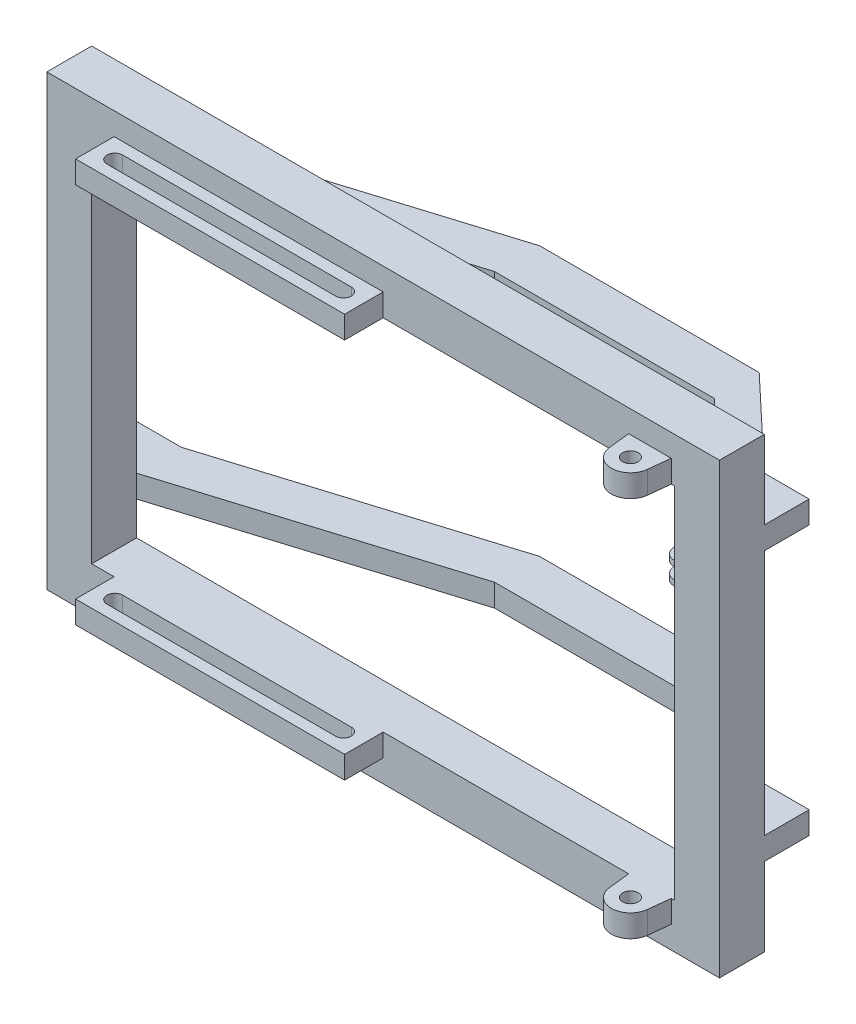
from build123d import *

# Parameters (mm, degrees)
SKETCH1_W           = 3000
SKETCH1_H           = 2000
SKETCH1_W_2         = 2600
SKETCH1_H_2         = 1600
BASE_EXTRUDE_DEPTH  = 100
SKETCH2_W           = 2990
SKETCH2_H           = 1990
SKETCH2_W_2         = 2610
SKETCH2_H_2         = 1610
CUT_EXTRUDE1_DEPTH  = 95
SKETCH3_W           = 1200
SKETCH3_H           = 172
BOSS_EXTRUDE2_DEPTH = 100
SKETCH4_R           = 35
BOSS_EXTRUDE3_DEPTH = 100
BOSS_EXTRUDE4_DEPTH = 50
BOSS_EXTRUDE5_DEPTH = 50
CUT_EXTRUDE2_DEPTH  = 40
CUT_EXTRUDE3_DEPTH  = 40
BOSS_EXTRUDE6_START = -200
SKETCH9_W           = 130
SKETCH9_H           = 1100
BOSS_EXTRUDE6_DEPTH = 200
SKETCH11_R          = 22.5
BOSS_EXTRUDE7_DEPTH = 50
SKETCH12_R          = 55
CUT_EXTRUDE4_DEPTH  = 25


with BuildPart() as part:
    # Sketch1 → Base-Extrude (new, symmetric)
    with BuildSketch(Plane.XY):
        Rectangle(SKETCH1_W, SKETCH1_H)
        Rectangle(SKETCH1_W_2, SKETCH1_H_2, mode=Mode.SUBTRACT)
    extrude(amount=BASE_EXTRUDE_DEPTH, both=True)

    # Sketch2 → Cut-Extrude1 (cut, symmetric)
    with BuildSketch(Plane.XY):
        Rectangle(SKETCH2_W, SKETCH2_H)
        Rectangle(SKETCH2_W_2, SKETCH2_H_2, mode=Mode.SUBTRACT)
    extrude(amount=CUT_EXTRUDE1_DEPTH, both=True, mode=Mode.SUBTRACT)

    # Sketch3 → Boss-Extrude2 (add)
    with BuildSketch(Plane.XZ.offset(-800)):
        with Locations((-600, 186)):
            Rectangle(SKETCH3_W, SKETCH3_H)
        with BuildLine():
            Line((-1110, 222), (-90, 222))
            ThreePointArc((-90, 222), (-55, 187), (-90, 152))
            Line((-90, 152), (-1110, 152))
            ThreePointArc((-1110, 152), (-1145, 187), (-1110, 222))
        make_face(mode=Mode.SUBTRACT)
    boss_extrude2 = extrude(amount=-BOSS_EXTRUDE2_DEPTH)

    # Mirror1: Boss-Extrude2 across plane
    add(boss_extrude2.mirror(Plane.ZX))

    # Sketch4 → Boss-Extrude3 (add)
    with BuildSketch(Plane.XZ.offset(-800)):
        with BuildLine():
            Line((1285, 100), (1274.49823031, 196.222205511))
            ThreePointArc((1274.49823031, 196.222205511), (1190, 272), (1105.50176969, 196.222205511))
            Line((1105.50176969, 196.222205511), (1095, 100))
            Line((1095, 100), (1285, 100))
        make_face()
        with Locations((1190, 187)):
            Circle(SKETCH4_R, mode=Mode.SUBTRACT)
    boss_extrude3 = extrude(amount=-BOSS_EXTRUDE3_DEPTH)

    # Mirror2: Boss-Extrude3 across plane
    add(boss_extrude3.mirror(Plane.ZX))

    # Sketch5 → Boss-Extrude4 (add, symmetric)
    with BuildSketch(Plane(origin=(0, 600, 0), x_dir=(1, 0, 0), z_dir=(0, 1, 0))):
        Polygon((-1500, 100), (-1300, 100), (-80, 477.253370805), (900, 477.253370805), (1300, 100), (1500, 100), (1500, 300), (1300, 300), (900, 677.253370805), (-80, 677.253370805), (-1300, 300), (-1500, 300), align=None)
    extrude(amount=BOSS_EXTRUDE4_DEPTH, both=True)

    # Sketch6 → Boss-Extrude5 (add, symmetric)
    with BuildSketch(Plane(origin=(0, -600, 0), x_dir=(1, 0, 0), z_dir=(0, 1, 0))):
        Polygon((-1500, 100), (-1300, 100), (-80, 477.253370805), (900, 477.253370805), (1300, 100), (1500, 100), (1500, 300), (1300, 300), (900, 677.253370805), (-80, 677.253370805), (-1300, 300), (-1500, 300), align=None)
    extrude(amount=BOSS_EXTRUDE5_DEPTH, both=True)

    # Sketch7 → Cut-Extrude2 (cut, symmetric)
    with BuildSketch(Plane(origin=(0, 600, 0), x_dir=(-1, 0, 0), z_dir=(0, 1, 0))):
        Polygon((1490, -110), (1490, -290), (1298.489171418, -290), (78.489171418, -667.253370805), (-896.028228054, -667.253370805), (-1296.028228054, -290), (-1490, -290), (-1490, -110), (-1303.971771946, -110), (-903.971771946, -487.253370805), (81.510828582, -487.253370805), (1301.510828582, -110), align=None)
    extrude(amount=CUT_EXTRUDE2_DEPTH, both=True, mode=Mode.SUBTRACT)

    # Sketch8 → Cut-Extrude3 (cut, symmetric)
    with BuildSketch(Plane(origin=(0, -600, 0), x_dir=(-1, 0, 0), z_dir=(0, 1, 0))):
        Polygon((1490, -110), (1490, -290), (1298.489171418, -290), (78.489171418, -667.253370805), (-896.028228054, -667.253370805), (-1296.028228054, -290), (-1490, -290), (-1490, -110), (-1303.971771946, -110), (-903.971771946, -487.253370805), (81.510828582, -487.253370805), (1301.510828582, -110), align=None)
    extrude(amount=CUT_EXTRUDE3_DEPTH, both=True, mode=Mode.SUBTRACT)

    # Sketch9 → Boss-Extrude6 (add)
    with BuildSketch(Plane(origin=(0, 0, -677.253370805), x_dir=(-1, 0, 0), z_dir=(0, 0, -1)).offset(BOSS_EXTRUDE6_START)):
        with Locations((-835, 0)):
            Rectangle(SKETCH9_W, SKETCH9_H)
    extrude(amount=BOSS_EXTRUDE6_DEPTH)

    # Sketch11 → Boss-Extrude7 (add, symmetric)
    with BuildSketch(Plane(origin=(0, 0, 0), x_dir=(1, 0, 0), z_dir=(0, 1, 0))):
        with BuildLine():
            Line((900, 477.253370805), (883.884185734, 402.253370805))
            ThreePointArc((883.884185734, 402.253370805), (835, 362.757483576), (786.115814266, 402.253370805))
            Line((786.115814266, 402.253370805), (770, 477.253370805))
            Line((770, 477.253370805), (900, 477.253370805))
        make_face()
        with Locations(Location((835, 412.757483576, 0), (0, 0, 270))):
            Circle(SKETCH11_R, mode=Mode.SUBTRACT)
    extrude(amount=BOSS_EXTRUDE7_DEPTH, both=True)

    # Sketch12 → Cut-Extrude4 (cut, symmetric)
    with BuildSketch(Plane(origin=(0, 0, 0), x_dir=(1, 0, 0), z_dir=(0, 1, 0))):
        with Locations((835, 412.757483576)):
            Circle(SKETCH12_R)
    extrude(amount=CUT_EXTRUDE4_DEPTH, both=True, mode=Mode.SUBTRACT)


solid = part.part
